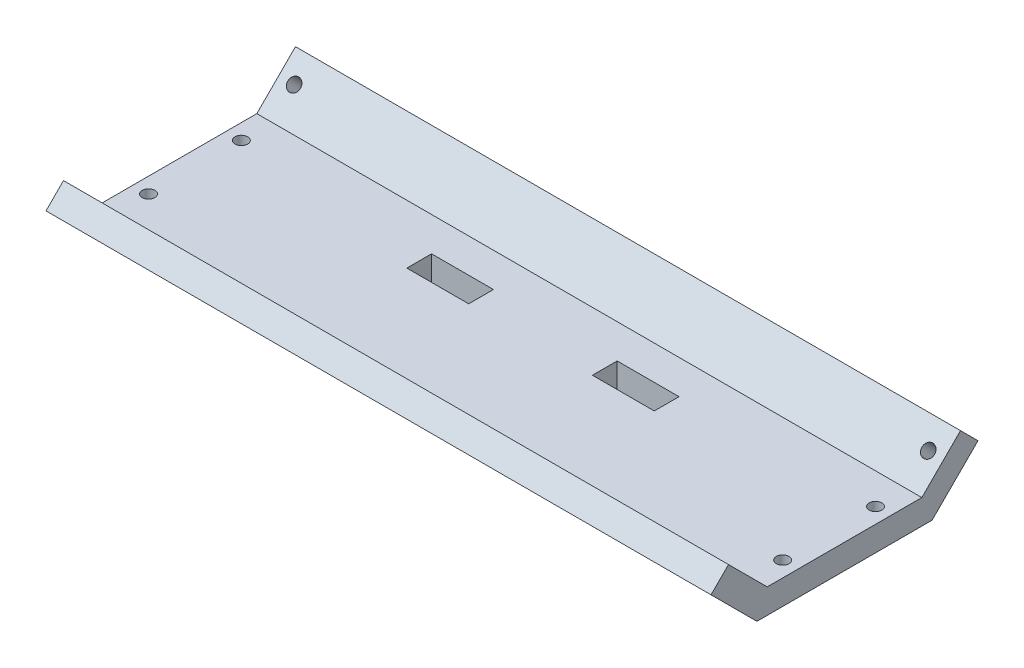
from build123d import *

# Parameters (mm, degrees)
MAIN_DEPTH                      = 107.5
F_4_0MM_DOWEL_HOLE2_D           = 4.1
F_4_0MM_DOWEL_HOLE2_ON_FACE_2_D = 4.1
F_4_0MM_DOWEL_HOLE2_ON_FACE_3_D = 4.1
F_4_0MM_DOWEL_HOLE2_ON_FACE_4_D = 4.1
SKETCH6_W                       = 20
SKETCH6_H                       = 8
SHELF_CUT_DEPTH                 = 117.511862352


with BuildPart() as part:
    # Sketch2 → Main (new, symmetric)
    with BuildSketch(Plane(origin=(0, 0, 0), x_dir=(0, 0, -1), z_dir=(1, 0, 0))):
        Polygon((-25, 0), (25, 0), (37.5, 12.5), (43.156854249, 6.843145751), (28.313708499, -8), (-28.313708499, -8), (-43.156854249, 6.843145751), (-37.5, 12.5), align=None)
    extrude(amount=MAIN_DEPTH, both=True)

    # 4.0mm Dowel Hole2 (through all)
    with Locations(Plane(origin=(-102.5, 7.071067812, -32.071067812), x_dir=(0, 0.707106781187, -0.707106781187), z_dir=(0, 0.707106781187, 0.707106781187))):
        with Locations((0, 0)):
            Hole(F_4_0MM_DOWEL_HOLE2_D / 2)

    # 4.0mm Dowel Hole2 on face 2 (through all)
    with Locations(Plane(origin=(-102.5, 0, -15), x_dir=(0, 0, 1), z_dir=(0, 1, 0))):
        with Locations((0, 0), (30, 0), (30, 205), (0, 205)):
            Hole(F_4_0MM_DOWEL_HOLE2_ON_FACE_2_D / 2)

    # 4.0mm Dowel Hole2 on face 3 (through all)
    with Locations(Plane(origin=(-102.5, 7.071067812, 32.071067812), x_dir=(0, -0.707106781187, -0.707106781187), z_dir=(0, 0.707106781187, -0.707106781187))):
        with Locations((0, 0), (0, -205)):
            Hole(F_4_0MM_DOWEL_HOLE2_ON_FACE_3_D / 2)

    # 4.0mm Dowel Hole2 on face 4 (through all)
    with Locations(Plane(origin=(102.5, 7.071067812, -32.071067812), x_dir=(0, 0.707106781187, -0.707106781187), z_dir=(0, 0.707106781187, 0.707106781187))):
        with Locations((0, 0)):
            Hole(F_4_0MM_DOWEL_HOLE2_ON_FACE_4_D / 2)

    # Sketch6 → Shelf cut (cut, through all)
    with BuildSketch(Plane(origin=(0, 0, 0), x_dir=(1, 0, 0), z_dir=(0, 1, 0))):
        with Locations((30, 10)):
            Rectangle(SKETCH6_W, SKETCH6_H)
        with Locations((-30, 10)):
            Rectangle(SKETCH6_W, SKETCH6_H)
    extrude(amount=-SHELF_CUT_DEPTH, mode=Mode.SUBTRACT)


solid = part.part
